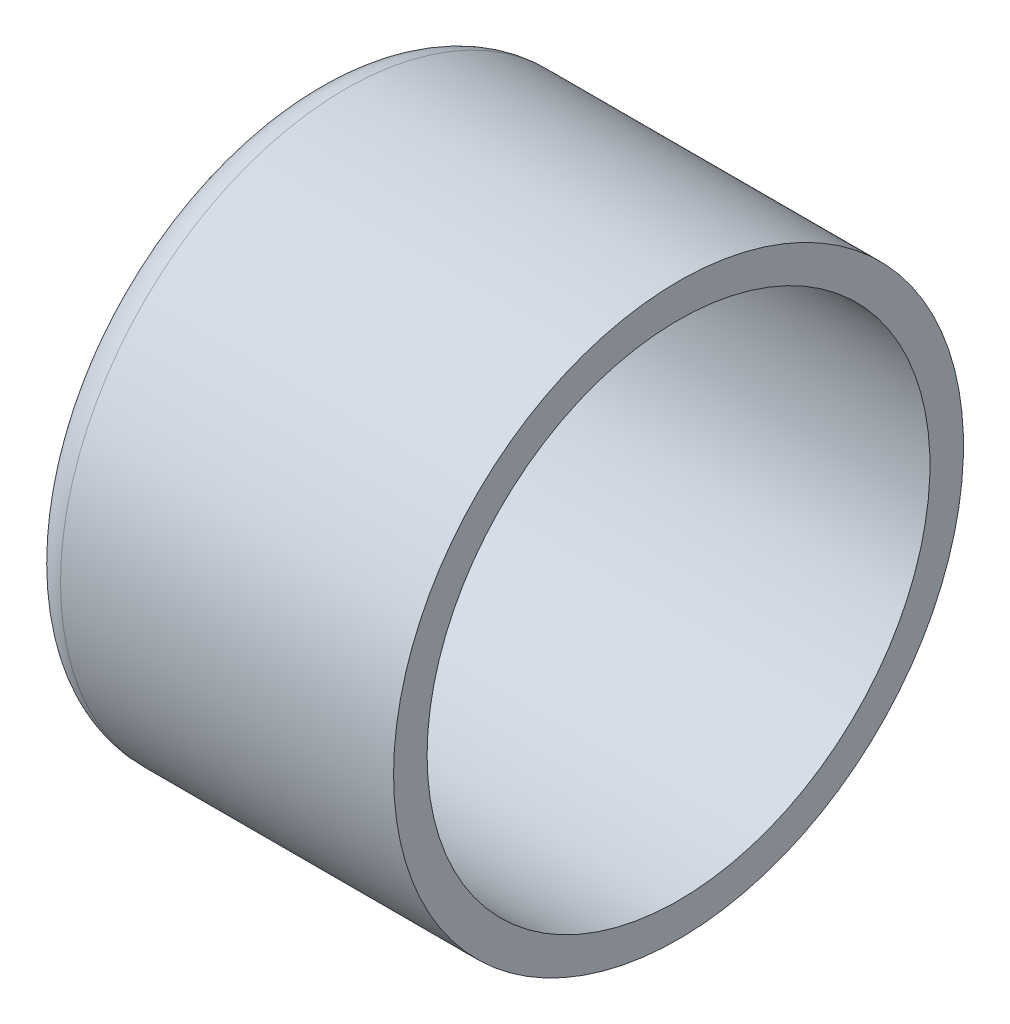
ISO-10303-21;
HEADER;
FILE_DESCRIPTION(('STEP AP214'),'2;1');
FILE_NAME('part.step','',(''),(''),'','','');
FILE_SCHEMA(('AUTOMOTIVE_DESIGN { 1 0 10303 214 1 1 1 1 }'));
ENDSEC;
DATA;
#1=APPLICATION_CONTEXT('core data for automotive mechanical design processes');
#2=APPLICATION_PROTOCOL_DEFINITION('international standard','automotive_design',2000,#1);
#3=PRODUCT_CONTEXT('',#1,'mechanical');
#4=PRODUCT('Part','Part','',(#3));
#5=PRODUCT_RELATED_PRODUCT_CATEGORY('part','',(#4));
#6=PRODUCT_DEFINITION_FORMATION('','',#4);
#7=PRODUCT_DEFINITION_CONTEXT('part definition',#1,'design');
#8=PRODUCT_DEFINITION('design','',#6,#7);
#9=PRODUCT_DEFINITION_SHAPE('','',#8);
#10=(LENGTH_UNIT() NAMED_UNIT(*) SI_UNIT(.MILLI.,.METRE.));
#11=(NAMED_UNIT(*) PLANE_ANGLE_UNIT() SI_UNIT($,.RADIAN.));
#12=(NAMED_UNIT(*) SI_UNIT($,.STERADIAN.) SOLID_ANGLE_UNIT());
#13=UNCERTAINTY_MEASURE_WITH_UNIT(LENGTH_MEASURE(1.E-05),#10,'distance_accuracy_value','');
#14=(GEOMETRIC_REPRESENTATION_CONTEXT(3) GLOBAL_UNCERTAINTY_ASSIGNED_CONTEXT((#13)) GLOBAL_UNIT_ASSIGNED_CONTEXT((#10,
#11,#12)) REPRESENTATION_CONTEXT('',''));
#15=CARTESIAN_POINT('',(0.,0.,0.));
#16=DIRECTION('',(0.,0.,1.));
#17=DIRECTION('',(1.,0.,0.));
#18=AXIS2_PLACEMENT_3D('',#15,#16,#17);
#19=CARTESIAN_POINT('',(32.8,22.5,0.));
#20=DIRECTION('',(-1.,0.,0.));
#21=DIRECTION('',(0.,0.,1.));
#22=AXIS2_PLACEMENT_3D('',#19,#20,#21);
#23=PLANE('',#22);
#24=CARTESIAN_POINT('',(32.8,0.,0.));
#25=DIRECTION('',(-1.,0.,0.));
#26=DIRECTION('',(0.,0.,1.));
#27=AXIS2_PLACEMENT_3D('',#24,#25,#26);
#28=CIRCLE('',#27,25.5);
#29=CARTESIAN_POINT('',(32.8,0.,25.5));
#30=VERTEX_POINT('',#29);
#31=EDGE_CURVE('E42',#30,#30,#28,.T.);
#32=ORIENTED_EDGE('',*,*,#31,.F.);
#33=EDGE_LOOP('',(#32));
#34=FACE_BOUND('',#33,.T.);
#35=CARTESIAN_POINT('',(32.8,0.,0.));
#36=DIRECTION('',(-1.,0.,0.));
#37=DIRECTION('',(0.,0.,1.));
#38=AXIS2_PLACEMENT_3D('',#35,#36,#37);
#39=CIRCLE('',#38,22.5);
#40=CARTESIAN_POINT('',(32.8,0.,22.5));
#41=VERTEX_POINT('',#40);
#42=EDGE_CURVE('E10',#41,#41,#39,.T.);
#43=ORIENTED_EDGE('',*,*,#42,.T.);
#44=EDGE_LOOP('',(#43));
#45=FACE_BOUND('',#44,.T.);
#46=ADVANCED_FACE('F28',(#34,#45),#23,.F.);
#47=CARTESIAN_POINT('',(-12.682650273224,0.,0.));
#48=DIRECTION('',(-1.,0.,0.));
#49=DIRECTION('',(0.,0.,1.));
#50=AXIS2_PLACEMENT_3D('',#47,#48,#49);
#51=CYLINDRICAL_SURFACE('',#50,22.5);
#52=ORIENTED_EDGE('',*,*,#42,.F.);
#53=EDGE_LOOP('',(#52));
#54=FACE_BOUND('',#53,.T.);
#55=CARTESIAN_POINT('',(0.,0.,0.));
#56=DIRECTION('',(-1.,0.,0.));
#57=DIRECTION('',(0.,0.,1.));
#58=AXIS2_PLACEMENT_3D('',#55,#56,#57);
#59=CIRCLE('',#58,22.5);
#60=CARTESIAN_POINT('',(0.,0.,22.5));
#61=VERTEX_POINT('',#60);
#62=EDGE_CURVE('E34',#61,#61,#59,.T.);
#63=ORIENTED_EDGE('',*,*,#62,.T.);
#64=EDGE_LOOP('',(#63));
#65=FACE_BOUND('',#64,.T.);
#66=ADVANCED_FACE('F51',(#54,#65),#51,.F.);
#67=CARTESIAN_POINT('',(3.,0.,0.));
#68=DIRECTION('',(-1.,0.,0.));
#69=DIRECTION('',(0.,0.,1.));
#70=AXIS2_PLACEMENT_3D('',#67,#68,#69);
#71=TOROIDAL_SURFACE('',#70,22.5,3.);
#72=ORIENTED_EDGE('',*,*,#62,.F.);
#73=EDGE_LOOP('',(#72));
#74=FACE_BOUND('',#73,.T.);
#75=CARTESIAN_POINT('',(3.00000000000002,0.,0.));
#76=DIRECTION('',(-1.,0.,0.));
#77=DIRECTION('',(0.,0.,1.));
#78=AXIS2_PLACEMENT_3D('',#75,#76,#77);
#79=CIRCLE('',#78,25.5);
#80=CARTESIAN_POINT('',(3.00000000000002,0.,25.5));
#81=VERTEX_POINT('',#80);
#82=EDGE_CURVE('E38',#81,#81,#79,.T.);
#83=ORIENTED_EDGE('',*,*,#82,.T.);
#84=EDGE_LOOP('',(#83));
#85=FACE_BOUND('',#84,.T.);
#86=ADVANCED_FACE('F55',(#74,#85),#71,.T.);
#87=CARTESIAN_POINT('',(-12.682650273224,0.,0.));
#88=DIRECTION('',(-1.,0.,0.));
#89=DIRECTION('',(0.,0.,1.));
#90=AXIS2_PLACEMENT_3D('',#87,#88,#89);
#91=CYLINDRICAL_SURFACE('',#90,25.5);
#92=ORIENTED_EDGE('',*,*,#82,.F.);
#93=EDGE_LOOP('',(#92));
#94=FACE_BOUND('',#93,.T.);
#95=ORIENTED_EDGE('',*,*,#31,.T.);
#96=EDGE_LOOP('',(#95));
#97=FACE_BOUND('',#96,.T.);
#98=ADVANCED_FACE('F48',(#94,#97),#91,.T.);
#99=CLOSED_SHELL('',(#46,#66,#86,#98));
#100=MANIFOLD_SOLID_BREP('B2',#99);
#101=ADVANCED_BREP_SHAPE_REPRESENTATION('',(#18,#100),#14);
#102=SHAPE_DEFINITION_REPRESENTATION(#9,#101);
ENDSEC;
END-ISO-10303-21;
